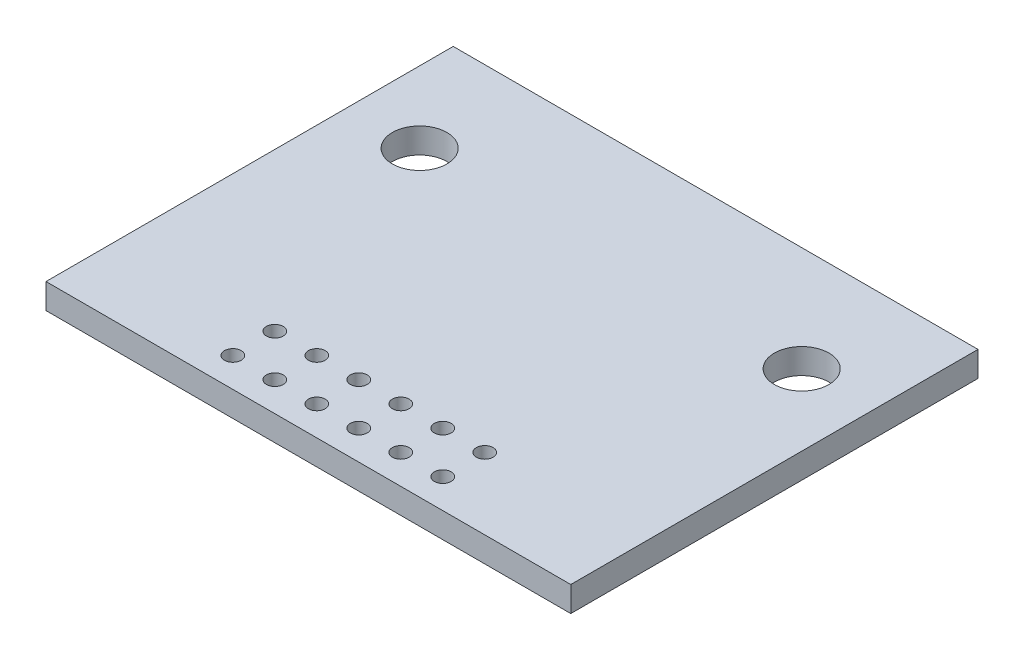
ISO-10303-21;
HEADER;
FILE_DESCRIPTION(('STEP AP214'),'2;1');
FILE_NAME('part.step','',(''),(''),'','','');
FILE_SCHEMA(('AUTOMOTIVE_DESIGN { 1 0 10303 214 1 1 1 1 }'));
ENDSEC;
DATA;
#1=APPLICATION_CONTEXT('core data for automotive mechanical design processes');
#2=APPLICATION_PROTOCOL_DEFINITION('international standard','automotive_design',2000,#1);
#3=PRODUCT_CONTEXT('',#1,'mechanical');
#4=PRODUCT('Part','Part','',(#3));
#5=PRODUCT_RELATED_PRODUCT_CATEGORY('part','',(#4));
#6=PRODUCT_DEFINITION_FORMATION('','',#4);
#7=PRODUCT_DEFINITION_CONTEXT('part definition',#1,'design');
#8=PRODUCT_DEFINITION('design','',#6,#7);
#9=PRODUCT_DEFINITION_SHAPE('','',#8);
#10=(LENGTH_UNIT() NAMED_UNIT(*) SI_UNIT(.MILLI.,.METRE.));
#11=(NAMED_UNIT(*) PLANE_ANGLE_UNIT() SI_UNIT($,.RADIAN.));
#12=(NAMED_UNIT(*) SI_UNIT($,.STERADIAN.) SOLID_ANGLE_UNIT());
#13=UNCERTAINTY_MEASURE_WITH_UNIT(LENGTH_MEASURE(1.E-05),#10,'distance_accuracy_value','');
#14=(GEOMETRIC_REPRESENTATION_CONTEXT(3) GLOBAL_UNCERTAINTY_ASSIGNED_CONTEXT((#13)) GLOBAL_UNIT_ASSIGNED_CONTEXT((#10,
#11,#12)) REPRESENTATION_CONTEXT('',''));
#15=CARTESIAN_POINT('',(0.,0.,0.));
#16=DIRECTION('',(0.,0.,1.));
#17=DIRECTION('',(1.,0.,0.));
#18=AXIS2_PLACEMENT_3D('',#15,#16,#17);
#19=CARTESIAN_POINT('',(0.,1.524,0.));
#20=DIRECTION('',(0.,1.,0.));
#21=DIRECTION('',(0.,0.,1.00000000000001));
#22=AXIS2_PLACEMENT_3D('',#19,#20,#21);
#23=PLANE('',#22);
#24=CARTESIAN_POINT('',(4.31799999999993,1.524,-18.2880000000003));
#25=DIRECTION('',(0.,1.,0.));
#26=DIRECTION('',(0.,0.,1.00000000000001));
#27=AXIS2_PLACEMENT_3D('',#24,#25,#26);
#28=CIRCLE('',#27,1.651);
#29=CARTESIAN_POINT('',(4.31799999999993,1.524,-19.9390000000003));
#30=VERTEX_POINT('',#29);
#31=EDGE_CURVE('E178',#30,#30,#28,.T.);
#32=ORIENTED_EDGE('',*,*,#31,.F.);
#33=EDGE_LOOP('',(#32));
#34=FACE_BOUND('',#33,.T.);
#35=CARTESIAN_POINT('',(22.2250000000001,1.524,-1.77800000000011));
#36=DIRECTION('',(0.,1.,0.));
#37=DIRECTION('',(0.,0.,1.00000000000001));
#38=AXIS2_PLACEMENT_3D('',#35,#36,#37);
#39=CIRCLE('',#38,0.508000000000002);
#40=CARTESIAN_POINT('',(22.2250000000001,1.524,-1.27000000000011));
#41=VERTEX_POINT('',#40);
#42=EDGE_CURVE('E166',#41,#41,#39,.T.);
#43=ORIENTED_EDGE('',*,*,#42,.F.);
#44=EDGE_LOOP('',(#43));
#45=FACE_BOUND('',#44,.T.);
#46=CARTESIAN_POINT('',(12.0650000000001,1.524,-4.31800000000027));
#47=DIRECTION('',(0.,1.,0.));
#48=DIRECTION('',(0.,0.,1.00000000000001));
#49=AXIS2_PLACEMENT_3D('',#46,#47,#48);
#50=CIRCLE('',#49,0.507999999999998);
#51=CARTESIAN_POINT('',(12.0650000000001,1.524,-3.81000000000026));
#52=VERTEX_POINT('',#51);
#53=EDGE_CURVE('E154',#52,#52,#50,.T.);
#54=ORIENTED_EDGE('',*,*,#53,.F.);
#55=EDGE_LOOP('',(#54));
#56=FACE_BOUND('',#55,.T.);
#57=CARTESIAN_POINT('',(17.1450000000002,1.524,-4.31800000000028));
#58=DIRECTION('',(0.,1.,0.));
#59=DIRECTION('',(0.,0.,1.00000000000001));
#60=AXIS2_PLACEMENT_3D('',#57,#58,#59);
#61=CIRCLE('',#60,0.508000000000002);
#62=CARTESIAN_POINT('',(17.1450000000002,1.524,-3.81000000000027));
#63=VERTEX_POINT('',#62);
#64=EDGE_CURVE('E142',#63,#63,#61,.T.);
#65=ORIENTED_EDGE('',*,*,#64,.F.);
#66=EDGE_LOOP('',(#65));
#67=FACE_BOUND('',#66,.T.);
#68=CARTESIAN_POINT('',(19.6850000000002,1.524,-1.77800000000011));
#69=DIRECTION('',(0.,1.,0.));
#70=DIRECTION('',(0.,0.,1.00000000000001));
#71=AXIS2_PLACEMENT_3D('',#68,#69,#70);
#72=CIRCLE('',#71,0.508000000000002);
#73=CARTESIAN_POINT('',(19.6850000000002,1.524,-1.27000000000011));
#74=VERTEX_POINT('',#73);
#75=EDGE_CURVE('E130',#74,#74,#72,.T.);
#76=ORIENTED_EDGE('',*,*,#75,.F.);
#77=EDGE_LOOP('',(#76));
#78=FACE_BOUND('',#77,.T.);
#79=CARTESIAN_POINT('',(14.6050000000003,1.524,-1.778));
#80=DIRECTION('',(0.,1.,0.));
#81=DIRECTION('',(0.,0.,1.00000000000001));
#82=AXIS2_PLACEMENT_3D('',#79,#80,#81);
#83=CIRCLE('',#82,0.508000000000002);
#84=CARTESIAN_POINT('',(14.6050000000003,1.524,-1.27));
#85=VERTEX_POINT('',#84);
#86=EDGE_CURVE('E118',#85,#85,#83,.T.);
#87=ORIENTED_EDGE('',*,*,#86,.F.);
#88=EDGE_LOOP('',(#87));
#89=FACE_BOUND('',#88,.T.);
#90=CARTESIAN_POINT('',(9.52500000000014,1.524,-1.778));
#91=DIRECTION('',(0.,1.,0.));
#92=DIRECTION('',(0.,0.,1.00000000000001));
#93=AXIS2_PLACEMENT_3D('',#90,#91,#92);
#94=CIRCLE('',#93,0.508000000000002);
#95=CARTESIAN_POINT('',(9.52500000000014,1.524,-1.27));
#96=VERTEX_POINT('',#95);
#97=EDGE_CURVE('E97',#96,#96,#94,.T.);
#98=ORIENTED_EDGE('',*,*,#97,.F.);
#99=EDGE_LOOP('',(#98));
#100=FACE_BOUND('',#99,.T.);
#101=DIRECTION('',(0.,0.,1.00000000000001));
#102=VECTOR('',#101,1.);
#103=CARTESIAN_POINT('',(0.,1.52400000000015,-24.6380000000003));
#104=LINE('',#103,#102);
#105=CARTESIAN_POINT('',(0.,1.52400000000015,-24.6380000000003));
#106=VERTEX_POINT('',#105);
#107=CARTESIAN_POINT('',(0.,1.524,0.));
#108=VERTEX_POINT('',#107);
#109=EDGE_CURVE('E82',#106,#108,#104,.T.);
#110=ORIENTED_EDGE('',*,*,#109,.T.);
#111=DIRECTION('',(1.00000000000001,0.,0.));
#112=VECTOR('',#111,1.);
#113=CARTESIAN_POINT('',(0.,1.524,0.));
#114=LINE('',#113,#112);
#115=CARTESIAN_POINT('',(31.7500000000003,1.524,0.));
#116=VERTEX_POINT('',#115);
#117=EDGE_CURVE('E77',#108,#116,#114,.T.);
#118=ORIENTED_EDGE('',*,*,#117,.T.);
#119=DIRECTION('',(0.,0.,-1.00000000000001));
#120=VECTOR('',#119,1.);
#121=CARTESIAN_POINT('',(31.7500000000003,1.52400000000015,-24.6380000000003));
#122=LINE('',#121,#120);
#123=CARTESIAN_POINT('',(31.7500000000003,1.52400000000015,-24.6380000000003));
#124=VERTEX_POINT('',#123);
#125=EDGE_CURVE('E80',#116,#124,#122,.T.);
#126=ORIENTED_EDGE('',*,*,#125,.T.);
#127=DIRECTION('',(-1.00000000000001,0.,0.));
#128=VECTOR('',#127,1.);
#129=CARTESIAN_POINT('',(0.,1.52400000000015,-24.6380000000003));
#130=LINE('',#129,#128);
#131=EDGE_CURVE('E47',#124,#106,#130,.T.);
#132=ORIENTED_EDGE('',*,*,#131,.T.);
#133=EDGE_LOOP('',(#110,#118,#126,#132));
#134=FACE_BOUND('',#133,.T.);
#135=CARTESIAN_POINT('',(12.0650000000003,1.524,-1.778));
#136=DIRECTION('',(0.,1.,0.));
#137=DIRECTION('',(0.,0.,1.00000000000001));
#138=AXIS2_PLACEMENT_3D('',#135,#136,#137);
#139=CIRCLE('',#138,0.507999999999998);
#140=CARTESIAN_POINT('',(12.0650000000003,1.524,-1.27));
#141=VERTEX_POINT('',#140);
#142=EDGE_CURVE('E112',#141,#141,#139,.T.);
#143=ORIENTED_EDGE('',*,*,#142,.F.);
#144=EDGE_LOOP('',(#143));
#145=FACE_BOUND('',#144,.T.);
#146=CARTESIAN_POINT('',(17.1450000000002,1.524,-1.77800000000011));
#147=DIRECTION('',(0.,1.,0.));
#148=DIRECTION('',(0.,0.,1.00000000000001));
#149=AXIS2_PLACEMENT_3D('',#146,#147,#148);
#150=CIRCLE('',#149,0.508000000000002);
#151=CARTESIAN_POINT('',(17.1450000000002,1.524,-1.27000000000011));
#152=VERTEX_POINT('',#151);
#153=EDGE_CURVE('E124',#152,#152,#150,.T.);
#154=ORIENTED_EDGE('',*,*,#153,.F.);
#155=EDGE_LOOP('',(#154));
#156=FACE_BOUND('',#155,.T.);
#157=CARTESIAN_POINT('',(19.6850000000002,1.524,-4.31800000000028));
#158=DIRECTION('',(0.,1.,0.));
#159=DIRECTION('',(0.,0.,1.00000000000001));
#160=AXIS2_PLACEMENT_3D('',#157,#158,#159);
#161=CIRCLE('',#160,0.508000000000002);
#162=CARTESIAN_POINT('',(19.6850000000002,1.524,-3.81000000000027));
#163=VERTEX_POINT('',#162);
#164=EDGE_CURVE('E136',#163,#163,#161,.T.);
#165=ORIENTED_EDGE('',*,*,#164,.F.);
#166=EDGE_LOOP('',(#165));
#167=FACE_BOUND('',#166,.T.);
#168=CARTESIAN_POINT('',(14.6050000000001,1.524,-4.31800000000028));
#169=DIRECTION('',(0.,1.,0.));
#170=DIRECTION('',(0.,0.,1.00000000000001));
#171=AXIS2_PLACEMENT_3D('',#168,#169,#170);
#172=CIRCLE('',#171,0.508000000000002);
#173=CARTESIAN_POINT('',(14.6050000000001,1.524,-3.81000000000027));
#174=VERTEX_POINT('',#173);
#175=EDGE_CURVE('E148',#174,#174,#172,.T.);
#176=ORIENTED_EDGE('',*,*,#175,.F.);
#177=EDGE_LOOP('',(#176));
#178=FACE_BOUND('',#177,.T.);
#179=CARTESIAN_POINT('',(9.52500000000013,1.524,-4.31800000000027));
#180=DIRECTION('',(0.,1.,0.));
#181=DIRECTION('',(0.,0.,1.00000000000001));
#182=AXIS2_PLACEMENT_3D('',#179,#180,#181);
#183=CIRCLE('',#182,0.508000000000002);
#184=CARTESIAN_POINT('',(9.52500000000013,1.524,-3.81000000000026));
#185=VERTEX_POINT('',#184);
#186=EDGE_CURVE('E160',#185,#185,#183,.T.);
#187=ORIENTED_EDGE('',*,*,#186,.F.);
#188=EDGE_LOOP('',(#187));
#189=FACE_BOUND('',#188,.T.);
#190=CARTESIAN_POINT('',(22.2250000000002,1.524,-4.31800000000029));
#191=DIRECTION('',(0.,1.,0.));
#192=DIRECTION('',(0.,0.,1.00000000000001));
#193=AXIS2_PLACEMENT_3D('',#190,#191,#192);
#194=CIRCLE('',#193,0.508000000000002);
#195=CARTESIAN_POINT('',(22.2250000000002,1.524,-3.81000000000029));
#196=VERTEX_POINT('',#195);
#197=EDGE_CURVE('E172',#196,#196,#194,.T.);
#198=ORIENTED_EDGE('',*,*,#197,.F.);
#199=EDGE_LOOP('',(#198));
#200=FACE_BOUND('',#199,.T.);
#201=CARTESIAN_POINT('',(27.4320000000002,1.524,-18.2880000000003));
#202=DIRECTION('',(0.,1.,0.));
#203=DIRECTION('',(0.,0.,1.00000000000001));
#204=AXIS2_PLACEMENT_3D('',#201,#202,#203);
#205=CIRCLE('',#204,1.651);
#206=CARTESIAN_POINT('',(27.4320000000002,1.524,-19.9390000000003));
#207=VERTEX_POINT('',#206);
#208=EDGE_CURVE('E184',#207,#207,#205,.T.);
#209=ORIENTED_EDGE('',*,*,#208,.F.);
#210=EDGE_LOOP('',(#209));
#211=FACE_BOUND('',#210,.T.);
#212=ADVANCED_FACE('F30',(#34,#45,#56,#67,#78,#89,#100,#134,#145,#156,#167,#178,#189,#200,#211),
#23,.T.);
#213=CARTESIAN_POINT('',(0.,0.,0.));
#214=DIRECTION('',(0.,1.,0.));
#215=DIRECTION('',(0.,0.,1.00000000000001));
#216=AXIS2_PLACEMENT_3D('',#213,#214,#215);
#217=PLANE('',#216);
#218=CARTESIAN_POINT('',(4.31799999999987,0.,-18.2880000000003));
#219=DIRECTION('',(0.,1.,0.));
#220=DIRECTION('',(0.,0.,1.00000000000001));
#221=AXIS2_PLACEMENT_3D('',#218,#219,#220);
#222=CIRCLE('',#221,1.651);
#223=CARTESIAN_POINT('',(4.31799999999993,0.,-19.9390000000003));
#224=VERTEX_POINT('',#223);
#225=EDGE_CURVE('E181',#224,#224,#222,.T.);
#226=ORIENTED_EDGE('',*,*,#225,.T.);
#227=EDGE_LOOP('',(#226));
#228=FACE_BOUND('',#227,.T.);
#229=CARTESIAN_POINT('',(22.2250000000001,0.,-1.77800000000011));
#230=DIRECTION('',(0.,1.,0.));
#231=DIRECTION('',(0.,0.,1.00000000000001));
#232=AXIS2_PLACEMENT_3D('',#229,#230,#231);
#233=CIRCLE('',#232,0.508000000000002);
#234=CARTESIAN_POINT('',(22.2250000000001,0.,-1.27000000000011));
#235=VERTEX_POINT('',#234);
#236=EDGE_CURVE('E169',#235,#235,#233,.T.);
#237=ORIENTED_EDGE('',*,*,#236,.T.);
#238=EDGE_LOOP('',(#237));
#239=FACE_BOUND('',#238,.T.);
#240=CARTESIAN_POINT('',(12.0650000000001,0.,-4.31800000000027));
#241=DIRECTION('',(0.,1.,0.));
#242=DIRECTION('',(0.,0.,1.00000000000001));
#243=AXIS2_PLACEMENT_3D('',#240,#241,#242);
#244=CIRCLE('',#243,0.507999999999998);
#245=CARTESIAN_POINT('',(12.0650000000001,0.,-3.81000000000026));
#246=VERTEX_POINT('',#245);
#247=EDGE_CURVE('E157',#246,#246,#244,.T.);
#248=ORIENTED_EDGE('',*,*,#247,.T.);
#249=EDGE_LOOP('',(#248));
#250=FACE_BOUND('',#249,.T.);
#251=CARTESIAN_POINT('',(17.1450000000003,0.,-4.31800000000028));
#252=DIRECTION('',(0.,1.,0.));
#253=DIRECTION('',(0.,0.,1.00000000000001));
#254=AXIS2_PLACEMENT_3D('',#251,#252,#253);
#255=CIRCLE('',#254,0.508000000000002);
#256=CARTESIAN_POINT('',(17.1450000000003,0.,-3.81000000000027));
#257=VERTEX_POINT('',#256);
#258=EDGE_CURVE('E145',#257,#257,#255,.T.);
#259=ORIENTED_EDGE('',*,*,#258,.T.);
#260=EDGE_LOOP('',(#259));
#261=FACE_BOUND('',#260,.T.);
#262=CARTESIAN_POINT('',(19.6850000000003,0.,-1.77800000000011));
#263=DIRECTION('',(0.,1.,0.));
#264=DIRECTION('',(0.,0.,1.00000000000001));
#265=AXIS2_PLACEMENT_3D('',#262,#263,#264);
#266=CIRCLE('',#265,0.508000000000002);
#267=CARTESIAN_POINT('',(19.6850000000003,0.,-1.27000000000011));
#268=VERTEX_POINT('',#267);
#269=EDGE_CURVE('E133',#268,#268,#266,.T.);
#270=ORIENTED_EDGE('',*,*,#269,.T.);
#271=EDGE_LOOP('',(#270));
#272=FACE_BOUND('',#271,.T.);
#273=CARTESIAN_POINT('',(14.6050000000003,0.,-1.778));
#274=DIRECTION('',(0.,1.,0.));
#275=DIRECTION('',(0.,0.,1.00000000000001));
#276=AXIS2_PLACEMENT_3D('',#273,#274,#275);
#277=CIRCLE('',#276,0.508000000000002);
#278=CARTESIAN_POINT('',(14.6050000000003,0.,-1.27));
#279=VERTEX_POINT('',#278);
#280=EDGE_CURVE('E121',#279,#279,#277,.T.);
#281=ORIENTED_EDGE('',*,*,#280,.T.);
#282=EDGE_LOOP('',(#281));
#283=FACE_BOUND('',#282,.T.);
#284=CARTESIAN_POINT('',(9.52500000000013,0.,-1.778));
#285=DIRECTION('',(0.,1.,0.));
#286=DIRECTION('',(0.,0.,1.00000000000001));
#287=AXIS2_PLACEMENT_3D('',#284,#285,#286);
#288=CIRCLE('',#287,0.508000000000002);
#289=CARTESIAN_POINT('',(9.52500000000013,0.,-1.27));
#290=VERTEX_POINT('',#289);
#291=EDGE_CURVE('E109',#290,#290,#288,.T.);
#292=ORIENTED_EDGE('',*,*,#291,.T.);
#293=EDGE_LOOP('',(#292));
#294=FACE_BOUND('',#293,.T.);
#295=DIRECTION('',(0.,0.,1.00000000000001));
#296=VECTOR('',#295,1.);
#297=CARTESIAN_POINT('',(0.,1.52655665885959E-13,-24.6380000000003));
#298=LINE('',#297,#296);
#299=CARTESIAN_POINT('',(0.,1.52655665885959E-13,-24.6380000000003));
#300=VERTEX_POINT('',#299);
#301=CARTESIAN_POINT('',(0.,0.,0.));
#302=VERTEX_POINT('',#301);
#303=EDGE_CURVE('E94',#300,#302,#298,.T.);
#304=ORIENTED_EDGE('',*,*,#303,.F.);
#305=DIRECTION('',(-1.00000000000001,0.,0.));
#306=VECTOR('',#305,1.);
#307=CARTESIAN_POINT('',(0.,1.52655665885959E-13,-24.6380000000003));
#308=LINE('',#307,#306);
#309=CARTESIAN_POINT('',(31.7500000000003,1.52655665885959E-13,-24.6380000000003));
#310=VERTEX_POINT('',#309);
#311=EDGE_CURVE('E70',#310,#300,#308,.T.);
#312=ORIENTED_EDGE('',*,*,#311,.F.);
#313=DIRECTION('',(0.,0.,-1.00000000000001));
#314=VECTOR('',#313,1.);
#315=CARTESIAN_POINT('',(31.7500000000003,1.52655665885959E-13,-24.6380000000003));
#316=LINE('',#315,#314);
#317=CARTESIAN_POINT('',(31.7500000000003,0.,0.));
#318=VERTEX_POINT('',#317);
#319=EDGE_CURVE('E64',#318,#310,#316,.T.);
#320=ORIENTED_EDGE('',*,*,#319,.F.);
#321=DIRECTION('',(1.00000000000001,0.,0.));
#322=VECTOR('',#321,1.);
#323=CARTESIAN_POINT('',(0.,0.,0.));
#324=LINE('',#323,#322);
#325=EDGE_CURVE('E86',#302,#318,#324,.T.);
#326=ORIENTED_EDGE('',*,*,#325,.F.);
#327=EDGE_LOOP('',(#304,#312,#320,#326));
#328=FACE_BOUND('',#327,.T.);
#329=CARTESIAN_POINT('',(12.0650000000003,0.,-1.778));
#330=DIRECTION('',(0.,1.,0.));
#331=DIRECTION('',(0.,0.,1.00000000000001));
#332=AXIS2_PLACEMENT_3D('',#329,#330,#331);
#333=CIRCLE('',#332,0.507999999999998);
#334=CARTESIAN_POINT('',(12.0650000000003,0.,-1.27));
#335=VERTEX_POINT('',#334);
#336=EDGE_CURVE('E115',#335,#335,#333,.T.);
#337=ORIENTED_EDGE('',*,*,#336,.T.);
#338=EDGE_LOOP('',(#337));
#339=FACE_BOUND('',#338,.T.);
#340=CARTESIAN_POINT('',(17.1450000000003,0.,-1.77800000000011));
#341=DIRECTION('',(0.,1.,0.));
#342=DIRECTION('',(0.,0.,1.00000000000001));
#343=AXIS2_PLACEMENT_3D('',#340,#341,#342);
#344=CIRCLE('',#343,0.508000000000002);
#345=CARTESIAN_POINT('',(17.1450000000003,0.,-1.27000000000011));
#346=VERTEX_POINT('',#345);
#347=EDGE_CURVE('E127',#346,#346,#344,.T.);
#348=ORIENTED_EDGE('',*,*,#347,.T.);
#349=EDGE_LOOP('',(#348));
#350=FACE_BOUND('',#349,.T.);
#351=CARTESIAN_POINT('',(19.6850000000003,0.,-4.31800000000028));
#352=DIRECTION('',(0.,1.,0.));
#353=DIRECTION('',(0.,0.,1.00000000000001));
#354=AXIS2_PLACEMENT_3D('',#351,#352,#353);
#355=CIRCLE('',#354,0.508000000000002);
#356=CARTESIAN_POINT('',(19.6850000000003,0.,-3.81000000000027));
#357=VERTEX_POINT('',#356);
#358=EDGE_CURVE('E139',#357,#357,#355,.T.);
#359=ORIENTED_EDGE('',*,*,#358,.T.);
#360=EDGE_LOOP('',(#359));
#361=FACE_BOUND('',#360,.T.);
#362=CARTESIAN_POINT('',(14.6050000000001,0.,-4.31800000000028));
#363=DIRECTION('',(0.,1.,0.));
#364=DIRECTION('',(0.,0.,1.00000000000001));
#365=AXIS2_PLACEMENT_3D('',#362,#363,#364);
#366=CIRCLE('',#365,0.508000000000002);
#367=CARTESIAN_POINT('',(14.6050000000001,0.,-3.81000000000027));
#368=VERTEX_POINT('',#367);
#369=EDGE_CURVE('E151',#368,#368,#366,.T.);
#370=ORIENTED_EDGE('',*,*,#369,.T.);
#371=EDGE_LOOP('',(#370));
#372=FACE_BOUND('',#371,.T.);
#373=CARTESIAN_POINT('',(9.52500000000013,0.,-4.31800000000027));
#374=DIRECTION('',(0.,1.,0.));
#375=DIRECTION('',(0.,0.,1.00000000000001));
#376=AXIS2_PLACEMENT_3D('',#373,#374,#375);
#377=CIRCLE('',#376,0.508000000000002);
#378=CARTESIAN_POINT('',(9.52500000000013,0.,-3.81000000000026));
#379=VERTEX_POINT('',#378);
#380=EDGE_CURVE('E163',#379,#379,#377,.T.);
#381=ORIENTED_EDGE('',*,*,#380,.T.);
#382=EDGE_LOOP('',(#381));
#383=FACE_BOUND('',#382,.T.);
#384=CARTESIAN_POINT('',(22.2250000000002,0.,-4.31800000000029));
#385=DIRECTION('',(0.,1.,0.));
#386=DIRECTION('',(0.,0.,1.00000000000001));
#387=AXIS2_PLACEMENT_3D('',#384,#385,#386);
#388=CIRCLE('',#387,0.508000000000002);
#389=CARTESIAN_POINT('',(22.2250000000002,0.,-3.81000000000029));
#390=VERTEX_POINT('',#389);
#391=EDGE_CURVE('E175',#390,#390,#388,.T.);
#392=ORIENTED_EDGE('',*,*,#391,.T.);
#393=EDGE_LOOP('',(#392));
#394=FACE_BOUND('',#393,.T.);
#395=CARTESIAN_POINT('',(27.4320000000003,0.,-18.2880000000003));
#396=DIRECTION('',(0.,1.,0.));
#397=DIRECTION('',(0.,0.,1.00000000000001));
#398=AXIS2_PLACEMENT_3D('',#395,#396,#397);
#399=CIRCLE('',#398,1.651);
#400=CARTESIAN_POINT('',(27.4320000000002,0.,-19.9390000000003));
#401=VERTEX_POINT('',#400);
#402=EDGE_CURVE('E187',#401,#401,#399,.T.);
#403=ORIENTED_EDGE('',*,*,#402,.T.);
#404=EDGE_LOOP('',(#403));
#405=FACE_BOUND('',#404,.T.);
#406=ADVANCED_FACE('F105',(#228,#239,#250,#261,#272,#283,#294,#328,#339,#350,#361,#372,#383,
#394,#405),#217,.F.);
#407=CARTESIAN_POINT('',(0.,1.52400000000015,-24.6380000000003));
#408=DIRECTION('',(1.00000000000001,0.,0.));
#409=DIRECTION('',(0.,0.,-1.00000000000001));
#410=AXIS2_PLACEMENT_3D('',#407,#408,#409);
#411=PLANE('',#410);
#412=ORIENTED_EDGE('',*,*,#303,.T.);
#413=DIRECTION('',(0.,-1.,0.));
#414=VECTOR('',#413,1.);
#415=CARTESIAN_POINT('',(0.,1.524,0.));
#416=LINE('',#415,#414);
#417=EDGE_CURVE('E11',#108,#302,#416,.T.);
#418=ORIENTED_EDGE('',*,*,#417,.F.);
#419=ORIENTED_EDGE('',*,*,#109,.F.);
#420=DIRECTION('',(0.,-1.,0.));
#421=VECTOR('',#420,1.);
#422=CARTESIAN_POINT('',(0.,1.52400000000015,-24.6380000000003));
#423=LINE('',#422,#421);
#424=EDGE_CURVE('E90',#106,#300,#423,.T.);
#425=ORIENTED_EDGE('',*,*,#424,.T.);
#426=EDGE_LOOP('',(#412,#418,#419,#425));
#427=FACE_BOUND('',#426,.T.);
#428=ADVANCED_FACE('F32',(#427),#411,.F.);
#429=CARTESIAN_POINT('',(0.,1.524,0.));
#430=DIRECTION('',(0.,0.,-1.00000000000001));
#431=DIRECTION('',(-1.00000000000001,0.,0.));
#432=AXIS2_PLACEMENT_3D('',#429,#430,#431);
#433=PLANE('',#432);
#434=ORIENTED_EDGE('',*,*,#325,.T.);
#435=DIRECTION('',(0.,-1.,0.));
#436=VECTOR('',#435,1.);
#437=CARTESIAN_POINT('',(31.7500000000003,1.524,0.));
#438=LINE('',#437,#436);
#439=EDGE_CURVE('E39',#116,#318,#438,.T.);
#440=ORIENTED_EDGE('',*,*,#439,.F.);
#441=ORIENTED_EDGE('',*,*,#117,.F.);
#442=ORIENTED_EDGE('',*,*,#417,.T.);
#443=EDGE_LOOP('',(#434,#440,#441,#442));
#444=FACE_BOUND('',#443,.T.);
#445=ADVANCED_FACE('F85',(#444),#433,.F.);
#446=CARTESIAN_POINT('',(31.7500000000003,1.52400000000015,-24.6380000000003));
#447=DIRECTION('',(-1.00000000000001,0.,0.));
#448=DIRECTION('',(0.,0.,1.00000000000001));
#449=AXIS2_PLACEMENT_3D('',#446,#447,#448);
#450=PLANE('',#449);
#451=ORIENTED_EDGE('',*,*,#319,.T.);
#452=DIRECTION('',(0.,-1.,0.));
#453=VECTOR('',#452,1.);
#454=CARTESIAN_POINT('',(31.7500000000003,1.52400000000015,-24.6380000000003));
#455=LINE('',#454,#453);
#456=EDGE_CURVE('E87',#124,#310,#455,.T.);
#457=ORIENTED_EDGE('',*,*,#456,.F.);
#458=ORIENTED_EDGE('',*,*,#125,.F.);
#459=ORIENTED_EDGE('',*,*,#439,.T.);
#460=EDGE_LOOP('',(#451,#457,#458,#459));
#461=FACE_BOUND('',#460,.T.);
#462=ADVANCED_FACE('F88',(#461),#450,.F.);
#463=CARTESIAN_POINT('',(0.,1.52400000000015,-24.6380000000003));
#464=DIRECTION('',(0.,0.,1.00000000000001));
#465=DIRECTION('',(1.00000000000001,0.,0.));
#466=AXIS2_PLACEMENT_3D('',#463,#464,#465);
#467=PLANE('',#466);
#468=ORIENTED_EDGE('',*,*,#311,.T.);
#469=ORIENTED_EDGE('',*,*,#424,.F.);
#470=ORIENTED_EDGE('',*,*,#131,.F.);
#471=ORIENTED_EDGE('',*,*,#456,.T.);
#472=EDGE_LOOP('',(#468,#469,#470,#471));
#473=FACE_BOUND('',#472,.T.);
#474=ADVANCED_FACE('F102',(#473),#467,.F.);
#475=CARTESIAN_POINT('',(9.52500000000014,1.524,-1.778));
#476=DIRECTION('',(0.,-1.,0.));
#477=DIRECTION('',(0.,0.,-1.00000000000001));
#478=AXIS2_PLACEMENT_3D('',#475,#476,#477);
#479=CYLINDRICAL_SURFACE('',#478,0.508000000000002);
#480=ORIENTED_EDGE('',*,*,#97,.T.);
#481=EDGE_LOOP('',(#480));
#482=FACE_BOUND('',#481,.T.);
#483=ORIENTED_EDGE('',*,*,#291,.F.);
#484=EDGE_LOOP('',(#483));
#485=FACE_BOUND('',#484,.T.);
#486=ADVANCED_FACE('F207',(#482,#485),#479,.F.);
#487=CARTESIAN_POINT('',(12.0650000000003,1.524,-1.778));
#488=DIRECTION('',(0.,-1.,0.));
#489=DIRECTION('',(0.,0.,-1.00000000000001));
#490=AXIS2_PLACEMENT_3D('',#487,#488,#489);
#491=CYLINDRICAL_SURFACE('',#490,0.507999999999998);
#492=ORIENTED_EDGE('',*,*,#142,.T.);
#493=EDGE_LOOP('',(#492));
#494=FACE_BOUND('',#493,.T.);
#495=ORIENTED_EDGE('',*,*,#336,.F.);
#496=EDGE_LOOP('',(#495));
#497=FACE_BOUND('',#496,.T.);
#498=ADVANCED_FACE('F242',(#494,#497),#491,.F.);
#499=CARTESIAN_POINT('',(14.6050000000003,1.524,-1.778));
#500=DIRECTION('',(0.,-1.,0.));
#501=DIRECTION('',(0.,0.,-1.00000000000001));
#502=AXIS2_PLACEMENT_3D('',#499,#500,#501);
#503=CYLINDRICAL_SURFACE('',#502,0.508000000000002);
#504=ORIENTED_EDGE('',*,*,#86,.T.);
#505=EDGE_LOOP('',(#504));
#506=FACE_BOUND('',#505,.T.);
#507=ORIENTED_EDGE('',*,*,#280,.F.);
#508=EDGE_LOOP('',(#507));
#509=FACE_BOUND('',#508,.T.);
#510=ADVANCED_FACE('F249',(#506,#509),#503,.F.);
#511=CARTESIAN_POINT('',(17.1450000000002,1.524,-1.77800000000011));
#512=DIRECTION('',(0.,-1.,0.));
#513=DIRECTION('',(0.,0.,-1.00000000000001));
#514=AXIS2_PLACEMENT_3D('',#511,#512,#513);
#515=CYLINDRICAL_SURFACE('',#514,0.508000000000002);
#516=ORIENTED_EDGE('',*,*,#153,.T.);
#517=EDGE_LOOP('',(#516));
#518=FACE_BOUND('',#517,.T.);
#519=ORIENTED_EDGE('',*,*,#347,.F.);
#520=EDGE_LOOP('',(#519));
#521=FACE_BOUND('',#520,.T.);
#522=ADVANCED_FACE('F256',(#518,#521),#515,.F.);
#523=CARTESIAN_POINT('',(19.6850000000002,1.524,-1.77800000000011));
#524=DIRECTION('',(0.,-1.,0.));
#525=DIRECTION('',(0.,0.,-1.00000000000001));
#526=AXIS2_PLACEMENT_3D('',#523,#524,#525);
#527=CYLINDRICAL_SURFACE('',#526,0.508000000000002);
#528=ORIENTED_EDGE('',*,*,#75,.T.);
#529=EDGE_LOOP('',(#528));
#530=FACE_BOUND('',#529,.T.);
#531=ORIENTED_EDGE('',*,*,#269,.F.);
#532=EDGE_LOOP('',(#531));
#533=FACE_BOUND('',#532,.T.);
#534=ADVANCED_FACE('F264',(#530,#533),#527,.F.);
#535=CARTESIAN_POINT('',(19.6850000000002,1.524,-4.31800000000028));
#536=DIRECTION('',(0.,-1.,0.));
#537=DIRECTION('',(0.,0.,-1.00000000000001));
#538=AXIS2_PLACEMENT_3D('',#535,#536,#537);
#539=CYLINDRICAL_SURFACE('',#538,0.508000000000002);
#540=ORIENTED_EDGE('',*,*,#164,.T.);
#541=EDGE_LOOP('',(#540));
#542=FACE_BOUND('',#541,.T.);
#543=ORIENTED_EDGE('',*,*,#358,.F.);
#544=EDGE_LOOP('',(#543));
#545=FACE_BOUND('',#544,.T.);
#546=ADVANCED_FACE('F272',(#542,#545),#539,.F.);
#547=CARTESIAN_POINT('',(17.1450000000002,1.524,-4.31800000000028));
#548=DIRECTION('',(0.,-1.,0.));
#549=DIRECTION('',(0.,0.,-1.00000000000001));
#550=AXIS2_PLACEMENT_3D('',#547,#548,#549);
#551=CYLINDRICAL_SURFACE('',#550,0.508000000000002);
#552=ORIENTED_EDGE('',*,*,#64,.T.);
#553=EDGE_LOOP('',(#552));
#554=FACE_BOUND('',#553,.T.);
#555=ORIENTED_EDGE('',*,*,#258,.F.);
#556=EDGE_LOOP('',(#555));
#557=FACE_BOUND('',#556,.T.);
#558=ADVANCED_FACE('F280',(#554,#557),#551,.F.);
#559=CARTESIAN_POINT('',(14.6050000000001,1.524,-4.31800000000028));
#560=DIRECTION('',(0.,-1.,0.));
#561=DIRECTION('',(0.,0.,-1.00000000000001));
#562=AXIS2_PLACEMENT_3D('',#559,#560,#561);
#563=CYLINDRICAL_SURFACE('',#562,0.508000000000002);
#564=ORIENTED_EDGE('',*,*,#175,.T.);
#565=EDGE_LOOP('',(#564));
#566=FACE_BOUND('',#565,.T.);
#567=ORIENTED_EDGE('',*,*,#369,.F.);
#568=EDGE_LOOP('',(#567));
#569=FACE_BOUND('',#568,.T.);
#570=ADVANCED_FACE('F288',(#566,#569),#563,.F.);
#571=CARTESIAN_POINT('',(12.0650000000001,1.524,-4.31800000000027));
#572=DIRECTION('',(0.,-1.,0.));
#573=DIRECTION('',(0.,0.,-1.00000000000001));
#574=AXIS2_PLACEMENT_3D('',#571,#572,#573);
#575=CYLINDRICAL_SURFACE('',#574,0.507999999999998);
#576=ORIENTED_EDGE('',*,*,#53,.T.);
#577=EDGE_LOOP('',(#576));
#578=FACE_BOUND('',#577,.T.);
#579=ORIENTED_EDGE('',*,*,#247,.F.);
#580=EDGE_LOOP('',(#579));
#581=FACE_BOUND('',#580,.T.);
#582=ADVANCED_FACE('F296',(#578,#581),#575,.F.);
#583=CARTESIAN_POINT('',(9.52500000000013,1.524,-4.31800000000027));
#584=DIRECTION('',(0.,-1.,0.));
#585=DIRECTION('',(0.,0.,-1.00000000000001));
#586=AXIS2_PLACEMENT_3D('',#583,#584,#585);
#587=CYLINDRICAL_SURFACE('',#586,0.508000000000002);
#588=ORIENTED_EDGE('',*,*,#186,.T.);
#589=EDGE_LOOP('',(#588));
#590=FACE_BOUND('',#589,.T.);
#591=ORIENTED_EDGE('',*,*,#380,.F.);
#592=EDGE_LOOP('',(#591));
#593=FACE_BOUND('',#592,.T.);
#594=ADVANCED_FACE('F304',(#590,#593),#587,.F.);
#595=CARTESIAN_POINT('',(22.2250000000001,1.524,-1.77800000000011));
#596=DIRECTION('',(0.,-1.,0.));
#597=DIRECTION('',(0.,0.,-1.00000000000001));
#598=AXIS2_PLACEMENT_3D('',#595,#596,#597);
#599=CYLINDRICAL_SURFACE('',#598,0.508000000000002);
#600=ORIENTED_EDGE('',*,*,#42,.T.);
#601=EDGE_LOOP('',(#600));
#602=FACE_BOUND('',#601,.T.);
#603=ORIENTED_EDGE('',*,*,#236,.F.);
#604=EDGE_LOOP('',(#603));
#605=FACE_BOUND('',#604,.T.);
#606=ADVANCED_FACE('F312',(#602,#605),#599,.F.);
#607=CARTESIAN_POINT('',(22.2250000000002,1.524,-4.31800000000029));
#608=DIRECTION('',(0.,-1.,0.));
#609=DIRECTION('',(0.,0.,-1.00000000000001));
#610=AXIS2_PLACEMENT_3D('',#607,#608,#609);
#611=CYLINDRICAL_SURFACE('',#610,0.508000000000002);
#612=ORIENTED_EDGE('',*,*,#197,.T.);
#613=EDGE_LOOP('',(#612));
#614=FACE_BOUND('',#613,.T.);
#615=ORIENTED_EDGE('',*,*,#391,.F.);
#616=EDGE_LOOP('',(#615));
#617=FACE_BOUND('',#616,.T.);
#618=ADVANCED_FACE('F320',(#614,#617),#611,.F.);
#619=CARTESIAN_POINT('',(4.31799999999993,1.524,-18.2880000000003));
#620=DIRECTION('',(0.,-1.,0.));
#621=DIRECTION('',(0.,0.,-1.00000000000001));
#622=AXIS2_PLACEMENT_3D('',#619,#620,#621);
#623=CYLINDRICAL_SURFACE('',#622,1.651);
#624=CARTESIAN_POINT('',(4.31799999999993,1.524,-19.9390000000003));
#625=CARTESIAN_POINT('',(4.31799999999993,1.508125,-19.9390000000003));
#626=CARTESIAN_POINT('',(4.31799999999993,1.49225,-19.9390000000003));
#627=CARTESIAN_POINT('',(4.31799999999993,1.4605,-19.9390000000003));
#628=CARTESIAN_POINT('',(4.31799999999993,1.444625,-19.9390000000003));
#629=CARTESIAN_POINT('',(4.31799999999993,1.412875,-19.9390000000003));
#630=CARTESIAN_POINT('',(4.31799999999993,1.397,-19.9390000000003));
#631=CARTESIAN_POINT('',(4.31799999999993,1.36525,-19.9390000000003));
#632=CARTESIAN_POINT('',(4.31799999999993,1.349375,-19.9390000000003));
#633=CARTESIAN_POINT('',(4.31799999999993,1.317625,-19.9390000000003));
#634=CARTESIAN_POINT('',(4.31799999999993,1.30175,-19.9390000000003));
#635=CARTESIAN_POINT('',(4.31799999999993,1.27,-19.9390000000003));
#636=CARTESIAN_POINT('',(4.31799999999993,1.254125,-19.9390000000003));
#637=CARTESIAN_POINT('',(4.31799999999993,1.222375,-19.9390000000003));
#638=CARTESIAN_POINT('',(4.31799999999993,1.2065,-19.9390000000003));
#639=CARTESIAN_POINT('',(4.31799999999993,1.17475,-19.9390000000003));
#640=CARTESIAN_POINT('',(4.31799999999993,1.158875,-19.9390000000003));
#641=CARTESIAN_POINT('',(4.31799999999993,1.127125,-19.9390000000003));
#642=CARTESIAN_POINT('',(4.31799999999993,1.11125,-19.9390000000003));
#643=CARTESIAN_POINT('',(4.31799999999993,1.0795,-19.9390000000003));
#644=CARTESIAN_POINT('',(4.31799999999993,1.063625,-19.9390000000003));
#645=CARTESIAN_POINT('',(4.31799999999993,1.031875,-19.9390000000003));
#646=CARTESIAN_POINT('',(4.31799999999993,1.016,-19.9390000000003));
#647=CARTESIAN_POINT('',(4.31799999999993,0.984249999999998,-19.9390000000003));
#648=CARTESIAN_POINT('',(4.31799999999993,0.968374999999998,-19.9390000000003));
#649=CARTESIAN_POINT('',(4.31799999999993,0.936624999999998,-19.9390000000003));
#650=CARTESIAN_POINT('',(4.31799999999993,0.920749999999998,-19.9390000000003));
#651=CARTESIAN_POINT('',(4.31799999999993,0.888999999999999,-19.9390000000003));
#652=CARTESIAN_POINT('',(4.31799999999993,0.873124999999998,-19.9390000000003));
#653=CARTESIAN_POINT('',(4.31799999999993,0.841374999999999,-19.9390000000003));
#654=CARTESIAN_POINT('',(4.31799999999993,0.825499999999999,-19.9390000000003));
#655=CARTESIAN_POINT('',(4.31799999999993,0.793749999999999,-19.9390000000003));
#656=CARTESIAN_POINT('',(4.31799999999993,0.777874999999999,-19.9390000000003));
#657=CARTESIAN_POINT('',(4.31799999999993,0.746124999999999,-19.9390000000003));
#658=CARTESIAN_POINT('',(4.31799999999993,0.730249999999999,-19.9390000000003));
#659=CARTESIAN_POINT('',(4.31799999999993,0.698499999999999,-19.9390000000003));
#660=CARTESIAN_POINT('',(4.31799999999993,0.682624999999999,-19.9390000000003));
#661=CARTESIAN_POINT('',(4.31799999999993,0.650874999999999,-19.9390000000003));
#662=CARTESIAN_POINT('',(4.31799999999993,0.634999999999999,-19.9390000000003));
#663=CARTESIAN_POINT('',(4.31799999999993,0.603249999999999,-19.9390000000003));
#664=CARTESIAN_POINT('',(4.31799999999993,0.587374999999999,-19.9390000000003));
#665=CARTESIAN_POINT('',(4.31799999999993,0.555624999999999,-19.9390000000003));
#666=CARTESIAN_POINT('',(4.31799999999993,0.539749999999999,-19.9390000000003));
#667=CARTESIAN_POINT('',(4.31799999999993,0.507999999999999,-19.9390000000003));
#668=CARTESIAN_POINT('',(4.31799999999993,0.492124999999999,-19.9390000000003));
#669=CARTESIAN_POINT('',(4.31799999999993,0.460374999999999,-19.9390000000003));
#670=CARTESIAN_POINT('',(4.31799999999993,0.444499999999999,-19.9390000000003));
#671=CARTESIAN_POINT('',(4.31799999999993,0.412749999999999,-19.9390000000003));
#672=CARTESIAN_POINT('',(4.31799999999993,0.396874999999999,-19.9390000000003));
#673=CARTESIAN_POINT('',(4.31799999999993,0.365124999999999,-19.9390000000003));
#674=CARTESIAN_POINT('',(4.31799999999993,0.349249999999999,-19.9390000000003));
#675=CARTESIAN_POINT('',(4.31799999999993,0.317499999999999,-19.9390000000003));
#676=CARTESIAN_POINT('',(4.31799999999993,0.301624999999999,-19.9390000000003));
#677=CARTESIAN_POINT('',(4.31799999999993,0.269874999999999,-19.9390000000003));
#678=CARTESIAN_POINT('',(4.31799999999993,0.253999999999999,-19.9390000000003));
#679=CARTESIAN_POINT('',(4.31799999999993,0.222249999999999,-19.9390000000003));
#680=CARTESIAN_POINT('',(4.31799999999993,0.206374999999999,-19.9390000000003));
#681=CARTESIAN_POINT('',(4.31799999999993,0.174625,-19.9390000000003));
#682=CARTESIAN_POINT('',(4.31799999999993,0.15875,-19.9390000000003));
#683=CARTESIAN_POINT('',(4.31799999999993,0.127,-19.9390000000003));
#684=CARTESIAN_POINT('',(4.31799999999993,0.111125,-19.9390000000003));
#685=CARTESIAN_POINT('',(4.31799999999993,0.0793749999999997,-19.9390000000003));
#686=CARTESIAN_POINT('',(4.31799999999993,0.0634999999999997,-19.9390000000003));
#687=CARTESIAN_POINT('',(4.31799999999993,0.0317499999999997,-19.9390000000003));
#688=CARTESIAN_POINT('',(4.31799999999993,0.0158749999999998,-19.9390000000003));
#689=CARTESIAN_POINT('',(4.31799999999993,0.,-19.9390000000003));
#690=B_SPLINE_CURVE_WITH_KNOTS('',3,(#624,#625,#626,#627,#628,#629,#630,#631,#632,#633,#634,
#635,#636,#637,#638,#639,#640,#641,#642,#643,#644,#645,#646,#647,#648,#649,#650,#651,#652,#653,
#654,#655,#656,#657,#658,#659,#660,#661,#662,#663,#664,#665,#666,#667,#668,#669,#670,#671,#672,
#673,#674,#675,#676,#677,#678,#679,#680,#681,#682,#683,#684,#685,#686,#687,#688,#689),
.UNSPECIFIED.,.F.,.F.,(4,2,2,2,2,2,2,2,2,2,2,2,2,2,2,2,2,2,2,2,2,2,2,2,2,2,2,2,2,2,2,2,4),(0.,
0.0476249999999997,0.0952499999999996,0.142875,0.190499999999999,0.238124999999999,
0.285749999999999,0.333374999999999,0.380999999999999,0.428624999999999,0.476249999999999,
0.523874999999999,0.571499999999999,0.619124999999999,0.666749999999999,0.714374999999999,
0.761999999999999,0.809624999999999,0.857249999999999,0.904874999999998,0.952499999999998,
1.000125,1.04775,1.095375,1.143,1.190625,1.23825,1.285875,1.3335,1.381125,1.42875,1.476375,
1.524),.UNSPECIFIED.);
#691=EDGE_CURVE('BSEAM328',#30,#224,#690,.T.);
#692=ORIENTED_EDGE('',*,*,#31,.T.);
#693=ORIENTED_EDGE('',*,*,#225,.F.);
#694=ORIENTED_EDGE('',*,*,#691,.T.);
#695=ORIENTED_EDGE('',*,*,#691,.F.);
#696=EDGE_LOOP('',(#692,#694,#693,#695));
#697=FACE_BOUND('',#696,.T.);
#698=ADVANCED_FACE('F328',(#697),#623,.F.);
#699=CARTESIAN_POINT('',(27.4320000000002,1.524,-18.2880000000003));
#700=DIRECTION('',(0.,-1.,0.));
#701=DIRECTION('',(0.,0.,-1.00000000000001));
#702=AXIS2_PLACEMENT_3D('',#699,#700,#701);
#703=CYLINDRICAL_SURFACE('',#702,1.651);
#704=CARTESIAN_POINT('',(27.4320000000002,1.524,-19.9390000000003));
#705=CARTESIAN_POINT('',(27.4320000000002,1.508125,-19.9390000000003));
#706=CARTESIAN_POINT('',(27.4320000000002,1.49225,-19.9390000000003));
#707=CARTESIAN_POINT('',(27.4320000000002,1.4605,-19.9390000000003));
#708=CARTESIAN_POINT('',(27.4320000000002,1.444625,-19.9390000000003));
#709=CARTESIAN_POINT('',(27.4320000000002,1.412875,-19.9390000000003));
#710=CARTESIAN_POINT('',(27.4320000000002,1.397,-19.9390000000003));
#711=CARTESIAN_POINT('',(27.4320000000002,1.36525,-19.9390000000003));
#712=CARTESIAN_POINT('',(27.4320000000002,1.349375,-19.9390000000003));
#713=CARTESIAN_POINT('',(27.4320000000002,1.317625,-19.9390000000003));
#714=CARTESIAN_POINT('',(27.4320000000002,1.30175,-19.9390000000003));
#715=CARTESIAN_POINT('',(27.4320000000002,1.27,-19.9390000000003));
#716=CARTESIAN_POINT('',(27.4320000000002,1.254125,-19.9390000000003));
#717=CARTESIAN_POINT('',(27.4320000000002,1.222375,-19.9390000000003));
#718=CARTESIAN_POINT('',(27.4320000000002,1.2065,-19.9390000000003));
#719=CARTESIAN_POINT('',(27.4320000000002,1.17475,-19.9390000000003));
#720=CARTESIAN_POINT('',(27.4320000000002,1.158875,-19.9390000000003));
#721=CARTESIAN_POINT('',(27.4320000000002,1.127125,-19.9390000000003));
#722=CARTESIAN_POINT('',(27.4320000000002,1.11125,-19.9390000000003));
#723=CARTESIAN_POINT('',(27.4320000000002,1.0795,-19.9390000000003));
#724=CARTESIAN_POINT('',(27.4320000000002,1.063625,-19.9390000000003));
#725=CARTESIAN_POINT('',(27.4320000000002,1.031875,-19.9390000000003));
#726=CARTESIAN_POINT('',(27.4320000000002,1.016,-19.9390000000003));
#727=CARTESIAN_POINT('',(27.4320000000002,0.984249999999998,-19.9390000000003));
#728=CARTESIAN_POINT('',(27.4320000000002,0.968374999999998,-19.9390000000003));
#729=CARTESIAN_POINT('',(27.4320000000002,0.936624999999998,-19.9390000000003));
#730=CARTESIAN_POINT('',(27.4320000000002,0.920749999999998,-19.9390000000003));
#731=CARTESIAN_POINT('',(27.4320000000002,0.888999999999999,-19.9390000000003));
#732=CARTESIAN_POINT('',(27.4320000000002,0.873124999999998,-19.9390000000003));
#733=CARTESIAN_POINT('',(27.4320000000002,0.841374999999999,-19.9390000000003));
#734=CARTESIAN_POINT('',(27.4320000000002,0.825499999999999,-19.9390000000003));
#735=CARTESIAN_POINT('',(27.4320000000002,0.793749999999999,-19.9390000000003));
#736=CARTESIAN_POINT('',(27.4320000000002,0.777874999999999,-19.9390000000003));
#737=CARTESIAN_POINT('',(27.4320000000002,0.746124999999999,-19.9390000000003));
#738=CARTESIAN_POINT('',(27.4320000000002,0.730249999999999,-19.9390000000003));
#739=CARTESIAN_POINT('',(27.4320000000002,0.698499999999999,-19.9390000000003));
#740=CARTESIAN_POINT('',(27.4320000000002,0.682624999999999,-19.9390000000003));
#741=CARTESIAN_POINT('',(27.4320000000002,0.650874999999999,-19.9390000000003));
#742=CARTESIAN_POINT('',(27.4320000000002,0.634999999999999,-19.9390000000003));
#743=CARTESIAN_POINT('',(27.4320000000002,0.603249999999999,-19.9390000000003));
#744=CARTESIAN_POINT('',(27.4320000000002,0.587374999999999,-19.9390000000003));
#745=CARTESIAN_POINT('',(27.4320000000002,0.555624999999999,-19.9390000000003));
#746=CARTESIAN_POINT('',(27.4320000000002,0.539749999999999,-19.9390000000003));
#747=CARTESIAN_POINT('',(27.4320000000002,0.507999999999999,-19.9390000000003));
#748=CARTESIAN_POINT('',(27.4320000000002,0.492124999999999,-19.9390000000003));
#749=CARTESIAN_POINT('',(27.4320000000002,0.460374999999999,-19.9390000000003));
#750=CARTESIAN_POINT('',(27.4320000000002,0.444499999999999,-19.9390000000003));
#751=CARTESIAN_POINT('',(27.4320000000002,0.412749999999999,-19.9390000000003));
#752=CARTESIAN_POINT('',(27.4320000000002,0.396874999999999,-19.9390000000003));
#753=CARTESIAN_POINT('',(27.4320000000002,0.365124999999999,-19.9390000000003));
#754=CARTESIAN_POINT('',(27.4320000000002,0.349249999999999,-19.9390000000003));
#755=CARTESIAN_POINT('',(27.4320000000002,0.317499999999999,-19.9390000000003));
#756=CARTESIAN_POINT('',(27.4320000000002,0.301624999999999,-19.9390000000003));
#757=CARTESIAN_POINT('',(27.4320000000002,0.269874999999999,-19.9390000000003));
#758=CARTESIAN_POINT('',(27.4320000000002,0.253999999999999,-19.9390000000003));
#759=CARTESIAN_POINT('',(27.4320000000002,0.222249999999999,-19.9390000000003));
#760=CARTESIAN_POINT('',(27.4320000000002,0.206374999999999,-19.9390000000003));
#761=CARTESIAN_POINT('',(27.4320000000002,0.174625,-19.9390000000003));
#762=CARTESIAN_POINT('',(27.4320000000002,0.15875,-19.9390000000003));
#763=CARTESIAN_POINT('',(27.4320000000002,0.127,-19.9390000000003));
#764=CARTESIAN_POINT('',(27.4320000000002,0.111125,-19.9390000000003));
#765=CARTESIAN_POINT('',(27.4320000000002,0.0793749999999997,-19.9390000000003));
#766=CARTESIAN_POINT('',(27.4320000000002,0.0634999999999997,-19.9390000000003));
#767=CARTESIAN_POINT('',(27.4320000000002,0.0317499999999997,-19.9390000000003));
#768=CARTESIAN_POINT('',(27.4320000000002,0.0158749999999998,-19.9390000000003));
#769=CARTESIAN_POINT('',(27.4320000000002,0.,-19.9390000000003));
#770=B_SPLINE_CURVE_WITH_KNOTS('',3,(#704,#705,#706,#707,#708,#709,#710,#711,#712,#713,#714,
#715,#716,#717,#718,#719,#720,#721,#722,#723,#724,#725,#726,#727,#728,#729,#730,#731,#732,#733,
#734,#735,#736,#737,#738,#739,#740,#741,#742,#743,#744,#745,#746,#747,#748,#749,#750,#751,#752,
#753,#754,#755,#756,#757,#758,#759,#760,#761,#762,#763,#764,#765,#766,#767,#768,#769),
.UNSPECIFIED.,.F.,.F.,(4,2,2,2,2,2,2,2,2,2,2,2,2,2,2,2,2,2,2,2,2,2,2,2,2,2,2,2,2,2,2,2,4),(0.,
0.0476249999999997,0.0952499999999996,0.142875,0.190499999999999,0.238124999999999,
0.285749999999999,0.333374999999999,0.380999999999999,0.428624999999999,0.476249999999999,
0.523874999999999,0.571499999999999,0.619124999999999,0.666749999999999,0.714374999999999,
0.761999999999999,0.809624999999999,0.857249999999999,0.904874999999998,0.952499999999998,
1.000125,1.04775,1.095375,1.143,1.190625,1.23825,1.285875,1.3335,1.381125,1.42875,1.476375,
1.524),.UNSPECIFIED.);
#771=EDGE_CURVE('BSEAM193',#207,#401,#770,.T.);
#772=ORIENTED_EDGE('',*,*,#208,.T.);
#773=ORIENTED_EDGE('',*,*,#402,.F.);
#774=ORIENTED_EDGE('',*,*,#771,.T.);
#775=ORIENTED_EDGE('',*,*,#771,.F.);
#776=EDGE_LOOP('',(#772,#774,#773,#775));
#777=FACE_BOUND('',#776,.T.);
#778=ADVANCED_FACE('F193',(#777),#703,.F.);
#779=CLOSED_SHELL('',(#212,#406,#428,#445,#462,#474,#486,#498,#510,#522,#534,#546,#558,#570,
#582,#594,#606,#618,#698,#778));
#780=MANIFOLD_SOLID_BREP('B2',#779);
#781=ADVANCED_BREP_SHAPE_REPRESENTATION('',(#18,#780),#14);
#782=SHAPE_DEFINITION_REPRESENTATION(#9,#781);
ENDSEC;
END-ISO-10303-21;
